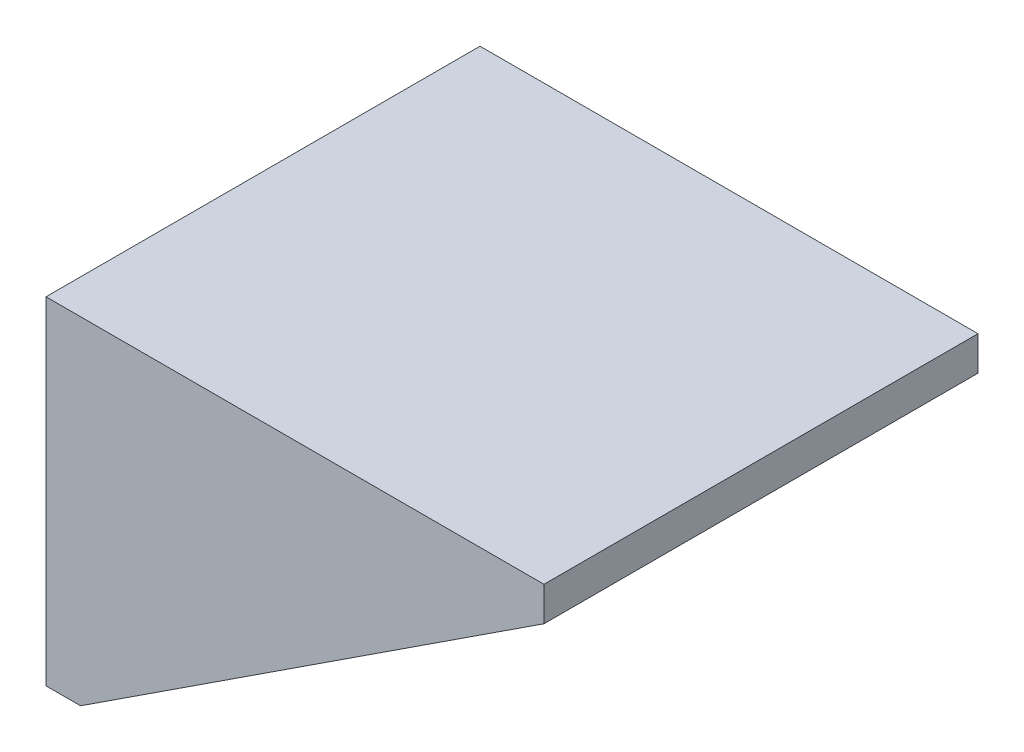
from build123d import *

# Parameters (mm, degrees)
BOSS_EXTRUDE1_DEPTH = 25.4


with BuildPart() as part:
    # Sketch1 → Boss-Extrude1 (new body)
    with BuildSketch(Plane.XY):
        Polygon((29.142291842, 110.792229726), (2.020506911, 93.074210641), (0, 93.074210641), (0, 112.794509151), (29.142291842, 112.794509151), align=None)
    extrude(amount=BOSS_EXTRUDE1_DEPTH)


solid = part.part
